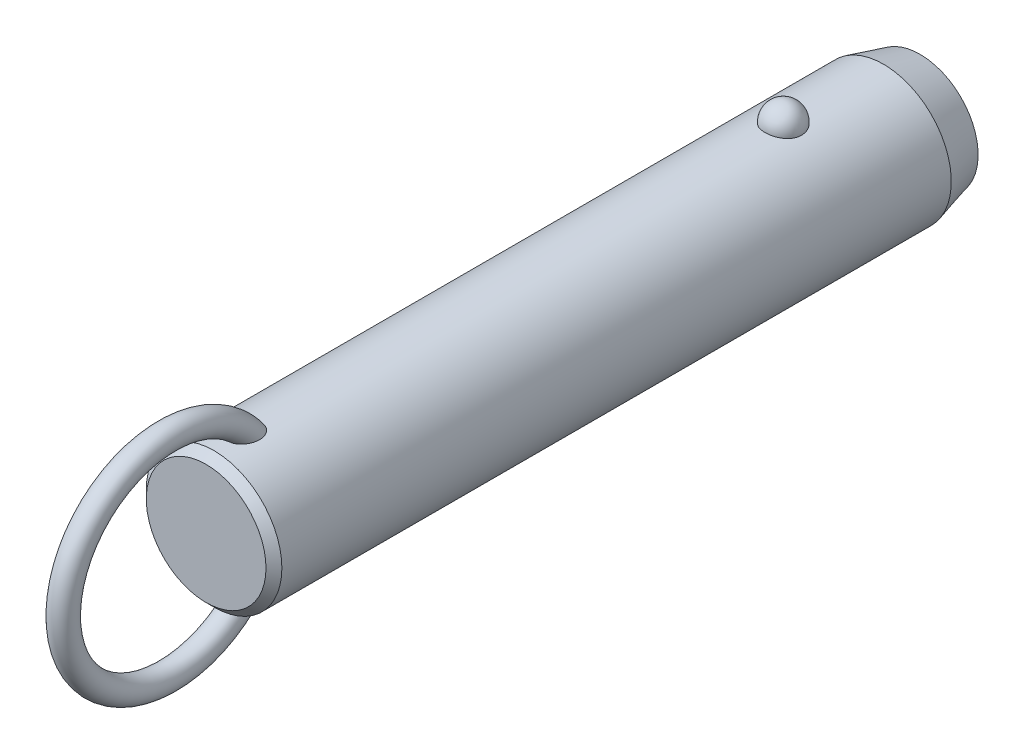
ISO-10303-21;
HEADER;
FILE_DESCRIPTION(('STEP AP214'),'2;1');
FILE_NAME('part.step','',(''),(''),'','','');
FILE_SCHEMA(('AUTOMOTIVE_DESIGN { 1 0 10303 214 1 1 1 1 }'));
ENDSEC;
DATA;
#1=APPLICATION_CONTEXT('core data for automotive mechanical design processes');
#2=APPLICATION_PROTOCOL_DEFINITION('international standard','automotive_design',2000,#1);
#3=PRODUCT_CONTEXT('',#1,'mechanical');
#4=PRODUCT('Part','Part','',(#3));
#5=PRODUCT_RELATED_PRODUCT_CATEGORY('part','',(#4));
#6=PRODUCT_DEFINITION_FORMATION('','',#4);
#7=PRODUCT_DEFINITION_CONTEXT('part definition',#1,'design');
#8=PRODUCT_DEFINITION('design','',#6,#7);
#9=PRODUCT_DEFINITION_SHAPE('','',#8);
#10=(LENGTH_UNIT() NAMED_UNIT(*) SI_UNIT(.MILLI.,.METRE.));
#11=(NAMED_UNIT(*) PLANE_ANGLE_UNIT() SI_UNIT($,.RADIAN.));
#12=(NAMED_UNIT(*) SI_UNIT($,.STERADIAN.) SOLID_ANGLE_UNIT());
#13=UNCERTAINTY_MEASURE_WITH_UNIT(LENGTH_MEASURE(1.E-05),#10,'distance_accuracy_value','');
#14=(GEOMETRIC_REPRESENTATION_CONTEXT(3) GLOBAL_UNCERTAINTY_ASSIGNED_CONTEXT((#13)) GLOBAL_UNIT_ASSIGNED_CONTEXT((#10,
#11,#12)) REPRESENTATION_CONTEXT('',''));
#15=CARTESIAN_POINT('',(0.,0.,0.));
#16=DIRECTION('',(0.,0.,1.));
#17=DIRECTION('',(1.,0.,0.));
#18=AXIS2_PLACEMENT_3D('',#15,#16,#17);
#19=CARTESIAN_POINT('',(0.,0.,78.8));
#20=DIRECTION('',(0.,0.,-1.));
#21=DIRECTION('',(-1.,0.,0.));
#22=AXIS2_PLACEMENT_3D('',#19,#20,#21);
#23=CYLINDRICAL_SURFACE('',#22,11.1);
#24=CARTESIAN_POINT('',(2.9724815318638,10.6945945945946,-3.));
#25=CARTESIAN_POINT('',(2.97247830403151,10.6945972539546,-2.83225059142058));
#26=CARTESIAN_POINT('',(2.95876598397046,10.6984356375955,-2.66445972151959));
#27=CARTESIAN_POINT('',(2.90424529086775,10.7133624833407,-2.33362381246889));
#28=CARTESIAN_POINT('',(2.8634252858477,10.7244540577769,-2.1705808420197));
#29=CARTESIAN_POINT('',(2.75573657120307,10.7526272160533,-1.85396767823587));
#30=CARTESIAN_POINT('',(2.68887937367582,10.7697061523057,-1.70039333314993));
#31=CARTESIAN_POINT('',(2.53079696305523,10.8079438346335,-1.40691598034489));
#32=CARTESIAN_POINT('',(2.43957264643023,10.8291024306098,-1.2670124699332));
#33=CARTESIAN_POINT('',(2.23458150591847,10.8732541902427,-1.00409565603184));
#34=CARTESIAN_POINT('',(2.12071295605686,10.8962553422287,-0.881162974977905));
#35=CARTESIAN_POINT('',(1.87365402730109,10.9414421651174,-0.656352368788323));
#36=CARTESIAN_POINT('',(1.74046358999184,10.9636278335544,-0.554474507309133));
#37=CARTESIAN_POINT('',(1.45872188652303,11.0046495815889,-0.374872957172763));
#38=CARTESIAN_POINT('',(1.31021276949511,11.0234944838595,-0.297085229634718));
#39=CARTESIAN_POINT('',(1.00170030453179,11.0557957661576,-0.167529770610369));
#40=CARTESIAN_POINT('',(0.841698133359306,11.0692526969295,-0.115759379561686));
#41=CARTESIAN_POINT('',(0.517607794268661,11.0890932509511,-0.0403925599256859));
#42=CARTESIAN_POINT('',(0.353633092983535,11.0955916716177,-0.0163383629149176));
#43=CARTESIAN_POINT('',(0.0238420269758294,11.1011989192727,0.0044517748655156));
#44=CARTESIAN_POINT('',(-0.141974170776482,11.1003084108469,0.00119017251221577));
#45=CARTESIAN_POINT('',(-0.468405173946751,11.0912990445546,-0.0323233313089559));
#46=CARTESIAN_POINT('',(-0.629059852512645,11.0832767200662,-0.0622147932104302));
#47=CARTESIAN_POINT('',(-0.942937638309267,11.0609962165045,-0.147645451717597));
#48=CARTESIAN_POINT('',(-1.09616062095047,11.0467379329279,-0.203185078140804));
#49=CARTESIAN_POINT('',(-1.39181061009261,11.0134071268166,-0.3387529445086));
#50=CARTESIAN_POINT('',(-1.53417383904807,10.9943086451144,-0.418913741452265));
#51=CARTESIAN_POINT('',(-1.80342160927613,10.9533667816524,-0.60144882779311));
#52=CARTESIAN_POINT('',(-1.9303046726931,10.9315231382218,-0.703825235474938));
#53=CARTESIAN_POINT('',(-2.16747598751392,10.887005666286,-0.930091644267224));
#54=CARTESIAN_POINT('',(-2.27742774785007,10.8643239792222,-1.05433291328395));
#55=CARTESIAN_POINT('',(-2.47517316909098,10.8209886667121,-1.31966633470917));
#56=CARTESIAN_POINT('',(-2.56296538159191,10.8003351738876,-1.46075958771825));
#57=CARTESIAN_POINT('',(-2.71500300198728,10.7631304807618,-1.75753646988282));
#58=CARTESIAN_POINT('',(-2.77898901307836,10.7466250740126,-1.91335887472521));
#59=CARTESIAN_POINT('',(-2.88046189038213,10.7198747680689,-2.2339152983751));
#60=CARTESIAN_POINT('',(-2.91794947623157,10.709629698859,-2.39864907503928));
#61=CARTESIAN_POINT('',(-2.96537819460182,10.6965949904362,-2.73165170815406));
#62=CARTESIAN_POINT('',(-2.97542891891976,10.693775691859,-2.89990378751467));
#63=CARTESIAN_POINT('',(-2.96804271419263,10.6958279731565,-3.235752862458));
#64=CARTESIAN_POINT('',(-2.95060646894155,10.7006993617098,-3.40334987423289));
#65=CARTESIAN_POINT('',(-2.88883358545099,10.71753912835,-3.73233906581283));
#66=CARTESIAN_POINT('',(-2.84462026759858,10.7294749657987,-3.89375610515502));
#67=CARTESIAN_POINT('',(-2.73050447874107,10.7590797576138,-4.20667949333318));
#68=CARTESIAN_POINT('',(-2.66060103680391,10.7767489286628,-4.35818546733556));
#69=CARTESIAN_POINT('',(-2.49642559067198,10.8159599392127,-4.6478542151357));
#70=CARTESIAN_POINT('',(-2.40203047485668,10.8375211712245,-4.78594458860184));
#71=CARTESIAN_POINT('',(-2.19143488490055,10.8820570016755,-5.0441038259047));
#72=CARTESIAN_POINT('',(-2.07523364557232,10.9050316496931,-5.16417205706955));
#73=CARTESIAN_POINT('',(-1.82361254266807,10.9499219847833,-5.38334833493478));
#74=CARTESIAN_POINT('',(-1.68812945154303,10.9718338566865,-5.48238464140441));
#75=CARTESIAN_POINT('',(-1.40191298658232,11.0120611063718,-5.65618873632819));
#76=CARTESIAN_POINT('',(-1.25118062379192,11.0303767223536,-5.73095813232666));
#77=CARTESIAN_POINT('',(-0.940570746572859,11.0611653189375,-5.85334725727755));
#78=CARTESIAN_POINT('',(-0.780821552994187,11.0737044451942,-5.90127578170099));
#79=CARTESIAN_POINT('',(-0.455204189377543,11.0918598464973,-5.96992976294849));
#80=CARTESIAN_POINT('',(-0.289336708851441,11.0974768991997,-5.99065827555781));
#81=CARTESIAN_POINT('',(0.0406846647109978,11.1011307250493,-6.00418773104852));
#82=CARTESIAN_POINT('',(0.204817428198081,11.099299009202,-5.99747318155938));
#83=CARTESIAN_POINT('',(0.5295530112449,11.088551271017,-5.9574031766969));
#84=CARTESIAN_POINT('',(0.69015594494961,11.0796354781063,-5.92404858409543));
#85=CARTESIAN_POINT('',(1.0027760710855,11.0557204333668,-5.83180084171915));
#86=CARTESIAN_POINT('',(1.15482001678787,11.0407414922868,-5.77299291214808));
#87=CARTESIAN_POINT('',(1.44678373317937,11.0062913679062,-5.63147366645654));
#88=CARTESIAN_POINT('',(1.58670279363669,10.9868199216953,-5.54876095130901));
#89=CARTESIAN_POINT('',(1.8527023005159,10.9451315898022,-5.36027644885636));
#90=CARTESIAN_POINT('',(1.97855158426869,10.9228788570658,-5.25418644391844));
#91=CARTESIAN_POINT('',(2.21080872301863,10.8782509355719,-5.02251354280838));
#92=CARTESIAN_POINT('',(2.31721312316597,10.8558757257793,-4.89692718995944));
#93=CARTESIAN_POINT('',(2.5094551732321,10.8130715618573,-4.62745408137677));
#94=CARTESIAN_POINT('',(2.59493284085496,10.7926798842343,-4.48330448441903));
#95=CARTESIAN_POINT('',(2.740862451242,10.7565495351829,-4.18236358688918));
#96=CARTESIAN_POINT('',(2.80132490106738,10.7408089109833,-4.02557762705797));
#97=CARTESIAN_POINT('',(2.88959070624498,10.7173718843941,-3.72475308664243));
#98=CARTESIAN_POINT('',(2.92062102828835,10.7088950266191,-3.58171216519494));
#99=CARTESIAN_POINT('',(2.96206765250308,10.6975052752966,-3.29245795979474));
#100=CARTESIAN_POINT('',(2.97248434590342,10.6945922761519,-3.14624473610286));
#101=CARTESIAN_POINT('',(2.9724815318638,10.6945945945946,-3.));
#102=B_SPLINE_CURVE_WITH_KNOTS('',3,(#24,#25,#26,#27,#28,#29,#30,#31,#32,#33,#34,#35,#36,#37,
#38,#39,#40,#41,#42,#43,#44,#45,#46,#47,#48,#49,#50,#51,#52,#53,#54,#55,#56,#57,#58,#59,#60,#61,
#62,#63,#64,#65,#66,#67,#68,#69,#70,#71,#72,#73,#74,#75,#76,#77,#78,#79,#80,#81,#82,#83,#84,#85,
#86,#87,#88,#89,#90,#91,#92,#93,#94,#95,#96,#97,#98,#99,#100,#101),.UNSPECIFIED.,.T.,.F.,(4,2,2,
2,2,2,2,2,2,2,2,2,2,2,2,2,2,2,2,2,2,2,2,2,2,2,2,2,2,2,2,2,2,2,2,2,2,2,4),(0.,0.502722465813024,
1.00566079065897,1.5083769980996,2.01107471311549,2.51608392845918,3.02109467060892,
3.52475118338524,4.02835620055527,4.523518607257,5.0186364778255,5.50715297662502,
5.9956776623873,6.48688002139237,6.97812923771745,7.47814366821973,7.9781907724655,
8.48353712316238,8.9888697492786,9.49218093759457,9.99547960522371,10.4964777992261,
10.997494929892,11.5010810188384,12.0046847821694,12.5099796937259,13.0152411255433,
13.5145635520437,14.0138298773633,14.5043200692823,14.9947943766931,15.4836390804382,
15.9725123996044,16.4685040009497,16.9645836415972,17.4686765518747,17.972557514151,
18.410841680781,18.849117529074),.UNSPECIFIED.);
#103=CARTESIAN_POINT('',(2.9724815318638,10.6945945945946,-3.));
#104=VERTEX_POINT('',#103);
#105=EDGE_CURVE('E41',#104,#104,#102,.T.);
#106=ORIENTED_EDGE('',*,*,#105,.T.);
#107=EDGE_LOOP('',(#106));
#108=FACE_BOUND('',#107,.T.);
#109=CARTESIAN_POINT('',(0.,0.,90.2));
#110=DIRECTION('',(0.,0.,1.));
#111=DIRECTION('',(1.,0.,0.));
#112=AXIS2_PLACEMENT_3D('',#109,#110,#111);
#113=CIRCLE('',#112,11.1);
#114=CARTESIAN_POINT('',(11.1,0.,90.2));
#115=VERTEX_POINT('',#114);
#116=EDGE_CURVE('E10',#115,#115,#113,.F.);
#117=ORIENTED_EDGE('',*,*,#116,.T.);
#118=EDGE_LOOP('',(#117));
#119=FACE_BOUND('',#118,.T.);
#120=CARTESIAN_POINT('',(-0.564520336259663,-11.0856356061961,82.4578154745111));
#121=CARTESIAN_POINT('',(-0.667202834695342,-11.0804062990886,82.4912839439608));
#122=CARTESIAN_POINT('',(-0.766875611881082,-11.0738877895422,82.5338357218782));
#123=CARTESIAN_POINT('',(-0.957284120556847,-11.0590576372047,82.6354190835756));
#124=CARTESIAN_POINT('',(-1.04801616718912,-11.0507452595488,82.6944574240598));
#125=CARTESIAN_POINT('',(-1.21800952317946,-11.0333016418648,82.8265293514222));
#126=CARTESIAN_POINT('',(-1.29730805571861,-11.0241732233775,82.8995156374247));
#127=CARTESIAN_POINT('',(-1.44337665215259,-11.0060026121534,83.0570374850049));
#128=CARTESIAN_POINT('',(-1.51014622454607,-10.9969604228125,83.1415734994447));
#129=CARTESIAN_POINT('',(-1.63454620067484,-10.9791841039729,83.3255213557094));
#130=CARTESIAN_POINT('',(-1.69127003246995,-10.9705107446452,83.4255493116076));
#131=CARTESIAN_POINT('',(-1.78980785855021,-10.9548648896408,83.6327902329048));
#132=CARTESIAN_POINT('',(-1.83161214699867,-10.9478935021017,83.7400078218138));
#133=CARTESIAN_POINT('',(-1.91557028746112,-10.9335803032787,84.0054080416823));
#134=CARTESIAN_POINT('',(-1.95040620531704,-10.9273269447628,84.1659806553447));
#135=CARTESIAN_POINT('',(-1.99388326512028,-10.9194709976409,84.4906977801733));
#136=CARTESIAN_POINT('',(-2.00248051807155,-10.9178762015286,84.6548478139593));
#137=CARTESIAN_POINT('',(-1.99551615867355,-10.9191578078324,85.0246504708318));
#138=CARTESIAN_POINT('',(-1.9732206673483,-10.9232807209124,85.2301911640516));
#139=CARTESIAN_POINT('',(-1.91529761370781,-10.9335244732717,85.5335954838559));
#140=CARTESIAN_POINT('',(-1.8918457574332,-10.9376266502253,85.6340883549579));
#141=CARTESIAN_POINT('',(-1.83700674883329,-10.9469720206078,85.832855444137));
#142=CARTESIAN_POINT('',(-1.80562070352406,-10.9522150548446,85.9311299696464));
#143=CARTESIAN_POINT('',(-1.73463055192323,-10.9636837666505,86.1259148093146));
#144=CARTESIAN_POINT('',(-1.69493416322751,-10.9699202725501,86.2223907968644));
#145=CARTESIAN_POINT('',(-1.6074514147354,-10.9830806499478,86.4116262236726));
#146=CARTESIAN_POINT('',(-1.55966150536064,-10.9900048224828,86.5043840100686));
#147=CARTESIAN_POINT('',(-1.45591812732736,-11.0042280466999,86.6846907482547));
#148=CARTESIAN_POINT('',(-1.40000013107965,-11.0115253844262,86.7722601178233));
#149=CARTESIAN_POINT('',(-1.27937470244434,-11.0261911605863,86.9410298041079));
#150=CARTESIAN_POINT('',(-1.21467835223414,-11.0335594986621,87.0222379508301));
#151=CARTESIAN_POINT('',(-1.08218150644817,-11.0473027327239,87.1690010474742));
#152=CARTESIAN_POINT('',(-1.01522633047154,-11.0537063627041,87.235309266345));
#153=CARTESIAN_POINT('',(-0.872952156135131,-11.065850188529,87.3583780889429));
#154=CARTESIAN_POINT('',(-0.797642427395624,-11.0715911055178,87.4151491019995));
#155=CARTESIAN_POINT('',(-0.651396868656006,-11.081071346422,87.5075155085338));
#156=CARTESIAN_POINT('',(-0.581712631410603,-11.0849841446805,87.5450491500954));
#157=CARTESIAN_POINT('',(-0.437066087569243,-11.0916271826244,87.6082594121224));
#158=CARTESIAN_POINT('',(-0.362109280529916,-11.0943586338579,87.6339481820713));
#159=CARTESIAN_POINT('',(-0.207828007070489,-11.0983242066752,87.671117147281));
#160=CARTESIAN_POINT('',(-0.128467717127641,-11.0995432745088,87.6824545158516));
#161=CARTESIAN_POINT('',(0.0309101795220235,-11.1002423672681,87.6889658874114));
#162=CARTESIAN_POINT('',(0.110927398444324,-11.0997233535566,87.6841488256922));
#163=CARTESIAN_POINT('',(0.256406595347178,-11.097240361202,87.6609599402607));
#164=CARTESIAN_POINT('',(0.32223577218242,-11.0955074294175,87.6447543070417));
#165=CARTESIAN_POINT('',(0.450635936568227,-11.0910350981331,87.6026008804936));
#166=CARTESIAN_POINT('',(0.513205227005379,-11.0882951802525,87.5766480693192));
#167=CARTESIAN_POINT('',(0.662626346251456,-11.0805620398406,87.5026073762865));
#168=CARTESIAN_POINT('',(0.747127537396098,-11.0751144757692,87.4498452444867));
#169=CARTESIAN_POINT('',(0.906756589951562,-11.0631932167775,87.3317206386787));
#170=CARTESIAN_POINT('',(0.981859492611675,-11.0567168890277,87.2663257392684));
#171=CARTESIAN_POINT('',(1.10712207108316,-11.0447856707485,87.1422633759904));
#172=CARTESIAN_POINT('',(1.15909566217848,-11.0394280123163,87.0853831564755));
#173=CARTESIAN_POINT('',(1.25791923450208,-11.0286040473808,86.9673271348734));
#174=CARTESIAN_POINT('',(1.30476642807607,-11.0231376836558,86.9061490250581));
#175=CARTESIAN_POINT('',(1.43818612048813,-11.0068027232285,86.717305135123));
#176=CARTESIAN_POINT('',(1.51751767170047,-10.9960104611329,86.5844531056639));
#177=CARTESIAN_POINT('',(1.63597546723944,-10.9788847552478,86.3531371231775));
#178=CARTESIAN_POINT('',(1.67988876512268,-10.9722190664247,86.2570530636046));
#179=CARTESIAN_POINT('',(1.75953241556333,-10.9597298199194,86.0614311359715));
#180=CARTESIAN_POINT('',(1.79525967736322,-10.9539065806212,85.9618919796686));
#181=CARTESIAN_POINT('',(1.85844731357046,-10.9433632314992,85.7602111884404));
#182=CARTESIAN_POINT('',(1.88591073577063,-10.9386427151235,85.6580705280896));
#183=CARTESIAN_POINT('',(1.93234324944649,-10.9305350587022,85.4518191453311));
#184=CARTESIAN_POINT('',(1.95131065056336,-10.9271481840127,85.3477080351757));
#185=CARTESIAN_POINT('',(1.99040203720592,-10.9201183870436,85.0654588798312));
#186=CARTESIAN_POINT('',(2.00221217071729,-10.9179256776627,84.8860370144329));
#187=CARTESIAN_POINT('',(1.99711676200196,-10.9188636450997,84.5277133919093));
#188=CARTESIAN_POINT('',(1.98026150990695,-10.9219849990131,84.348811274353));
#189=CARTESIAN_POINT('',(1.92151657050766,-10.9324473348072,84.0364514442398));
#190=CARTESIAN_POINT('',(1.88605081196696,-10.9386915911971,83.9017594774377));
#191=CARTESIAN_POINT('',(1.7939302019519,-10.9541780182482,83.6399669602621));
#192=CARTESIAN_POINT('',(1.73729868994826,-10.9634168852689,83.5128582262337));
#193=CARTESIAN_POINT('',(1.612370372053,-10.9824218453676,83.2894184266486));
#194=CARTESIAN_POINT('',(1.54715374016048,-10.9918945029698,83.1913455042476));
#195=CARTESIAN_POINT('',(1.40127026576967,-11.0114415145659,83.0074341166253));
#196=CARTESIAN_POINT('',(1.32060742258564,-11.0215157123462,82.9215924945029));
#197=CARTESIAN_POINT('',(1.14474787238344,-11.041168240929,82.7651630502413));
#198=CARTESIAN_POINT('',(1.04947805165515,-11.0507437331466,82.6946565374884));
#199=CARTESIAN_POINT('',(0.847278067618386,-11.0680789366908,82.572640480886));
#200=CARTESIAN_POINT('',(0.74035174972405,-11.0758392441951,82.5211246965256));
#201=CARTESIAN_POINT('',(0.52928931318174,-11.0878275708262,82.4434852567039));
#202=CARTESIAN_POINT('',(0.425895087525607,-11.0923259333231,82.415377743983));
#203=CARTESIAN_POINT('',(0.215723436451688,-11.0984001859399,82.3777038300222));
#204=CARTESIAN_POINT('',(0.108947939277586,-11.0999777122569,82.3681270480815));
#205=CARTESIAN_POINT('',(-0.0938962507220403,-11.1000196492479,82.3678773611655));
#206=CARTESIAN_POINT('',(-0.189967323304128,-11.0987797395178,82.3754089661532));
#207=CARTESIAN_POINT('',(-0.379657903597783,-11.0939111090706,82.4055079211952));
#208=CARTESIAN_POINT('',(-0.473277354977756,-11.0902823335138,82.4280756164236));
#209=CARTESIAN_POINT('',(-0.564520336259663,-11.0856356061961,82.4578154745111));
#210=B_SPLINE_CURVE_WITH_KNOTS('',3,(#120,#121,#122,#123,#124,#125,#126,#127,#128,#129,#130,
#131,#132,#133,#134,#135,#136,#137,#138,#139,#140,#141,#142,#143,#144,#145,#146,#147,#148,#149,
#150,#151,#152,#153,#154,#155,#156,#157,#158,#159,#160,#161,#162,#163,#164,#165,#166,#167,#168,
#169,#170,#171,#172,#173,#174,#175,#176,#177,#178,#179,#180,#181,#182,#183,#184,#185,#186,#187,
#188,#189,#190,#191,#192,#193,#194,#195,#196,#197,#198,#199,#200,#201,#202,#203,#204,#205,#206,
#207,#208,#209),.UNSPECIFIED.,.T.,.F.,(4,2,2,2,2,2,2,2,2,2,2,2,2,2,2,2,2,2,2,2,2,2,2,2,2,2,2,2,
2,2,2,2,2,2,2,2,2,2,2,2,2,2,2,2,4),(0.,0.323999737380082,0.648132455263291,0.971184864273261,
1.29424994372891,1.63886237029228,1.98369857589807,2.47426059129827,2.96564271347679,
3.58257396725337,3.89215258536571,4.20168803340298,4.51486273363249,4.82817514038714,
5.14015911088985,5.45175282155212,5.73442856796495,6.01679375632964,6.25364580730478,
6.49025437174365,6.7291996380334,6.96801276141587,7.17061258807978,7.37331685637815,
7.67094989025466,7.96935728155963,8.20075067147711,8.43226927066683,8.89581623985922,
9.2130653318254,9.53043400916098,9.84768549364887,10.1650000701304,10.70229304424,
11.2386443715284,11.6553390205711,12.0715755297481,12.4245637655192,12.7774607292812,
13.1321855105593,13.4867936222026,13.8068771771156,14.1267813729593,14.4146787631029,
14.7025827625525),.UNSPECIFIED.);
#211=CARTESIAN_POINT('',(-0.564520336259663,-11.0856356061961,82.4578154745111));
#212=VERTEX_POINT('',#211);
#213=EDGE_CURVE('E60',#212,#212,#210,.T.);
#214=ORIENTED_EDGE('',*,*,#213,.T.);
#215=EDGE_LOOP('',(#214));
#216=FACE_BOUND('',#215,.T.);
#217=CARTESIAN_POINT('',(-0.564520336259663,11.0856356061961,82.4578154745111));
#218=CARTESIAN_POINT('',(-0.468542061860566,11.0905203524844,82.4265456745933));
#219=CARTESIAN_POINT('',(-0.36979381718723,11.0942886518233,82.4031576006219));
#220=CARTESIAN_POINT('',(-0.169555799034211,11.0991586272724,82.3730858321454));
#221=CARTESIAN_POINT('',(-0.0680604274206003,11.1002543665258,82.3664393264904));
#222=CARTESIAN_POINT('',(0.134549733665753,11.099646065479,82.3701579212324));
#223=CARTESIAN_POINT('',(0.235664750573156,11.0979441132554,82.3805103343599));
#224=CARTESIAN_POINT('',(0.43463240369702,11.0919342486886,82.4178318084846));
#225=CARTESIAN_POINT('',(0.53248665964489,11.0876276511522,82.4447924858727));
#226=CARTESIAN_POINT('',(0.72244585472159,11.0768742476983,82.5144096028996));
#227=CARTESIAN_POINT('',(0.814543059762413,11.0704246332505,82.5570866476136));
#228=CARTESIAN_POINT('',(0.990565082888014,11.0560659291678,82.6566487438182));
#229=CARTESIAN_POINT('',(1.07448844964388,11.048156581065,82.7135363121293));
#230=CARTESIAN_POINT('',(1.23562672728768,11.0313221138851,82.8422106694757));
#231=CARTESIAN_POINT('',(1.31242684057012,11.0223686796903,82.9145117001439));
#232=CARTESIAN_POINT('',(1.45398030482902,11.0045918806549,83.0700425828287));
#233=CARTESIAN_POINT('',(1.51873073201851,10.9957685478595,83.1532750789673));
#234=CARTESIAN_POINT('',(1.64107232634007,10.9782087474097,83.3363842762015));
#235=CARTESIAN_POINT('',(1.69743176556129,10.9695572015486,83.4370893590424));
#236=CARTESIAN_POINT('',(1.79515063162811,10.9539887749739,83.6456264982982));
#237=CARTESIAN_POINT('',(1.83649966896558,10.9470730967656,83.7534634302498));
#238=CARTESIAN_POINT('',(1.91931148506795,10.9329211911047,84.0203995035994));
#239=CARTESIAN_POINT('',(1.9534010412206,10.9267904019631,84.1818612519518));
#240=CARTESIAN_POINT('',(1.99526195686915,10.9192174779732,84.5082163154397));
#241=CARTESIAN_POINT('',(2.00298989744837,10.9177830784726,84.6731148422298));
#242=CARTESIAN_POINT('',(1.99396251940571,10.9194420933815,85.0441006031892));
#243=CARTESIAN_POINT('',(1.97050829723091,10.923774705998,85.2500387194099));
#244=CARTESIAN_POINT('',(1.91079643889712,10.9343131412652,85.5539019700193));
#245=CARTESIAN_POINT('',(1.88673702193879,10.9385106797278,85.6545296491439));
#246=CARTESIAN_POINT('',(1.83065508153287,10.9480376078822,85.8535107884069));
#247=CARTESIAN_POINT('',(1.79863369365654,10.9533668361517,85.951864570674));
#248=CARTESIAN_POINT('',(1.72633365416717,10.9649954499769,86.146720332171));
#249=CARTESIAN_POINT('',(1.68596409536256,10.9713053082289,86.2431879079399));
#250=CARTESIAN_POINT('',(1.59707998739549,10.9845964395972,86.4323233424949));
#251=CARTESIAN_POINT('',(1.54856169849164,10.9915780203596,86.5249894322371));
#252=CARTESIAN_POINT('',(1.44330168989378,11.0058935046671,86.7049752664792));
#253=CARTESIAN_POINT('',(1.38659749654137,11.0132257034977,86.792316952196));
#254=CARTESIAN_POINT('',(1.26431158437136,11.0279330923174,86.9604563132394));
#255=CARTESIAN_POINT('',(1.19874160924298,11.0353082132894,87.0412624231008));
#256=CARTESIAN_POINT('',(1.06542088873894,11.0489310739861,87.1859856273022));
#257=CARTESIAN_POINT('',(0.998640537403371,11.0552153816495,87.250784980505));
#258=CARTESIAN_POINT('',(0.856896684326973,11.0671032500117,87.370846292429));
#259=CARTESIAN_POINT('',(0.781942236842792,11.0727075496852,87.4261186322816));
#260=CARTESIAN_POINT('',(0.636276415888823,11.081949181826,87.5159721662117));
#261=CARTESIAN_POINT('',(0.5667558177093,11.0857572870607,87.5524410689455));
#262=CARTESIAN_POINT('',(0.422602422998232,11.0921860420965,87.6135333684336));
#263=CARTESIAN_POINT('',(0.347974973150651,11.0948079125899,87.6381689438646));
#264=CARTESIAN_POINT('',(0.194593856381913,11.0985608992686,87.6733233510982));
#265=CARTESIAN_POINT('',(0.115807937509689,11.0996777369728,87.6837069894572));
#266=CARTESIAN_POINT('',(-0.0422499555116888,11.1002003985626,87.6885747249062));
#267=CARTESIAN_POINT('',(-0.121521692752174,11.09960699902,87.683066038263));
#268=CARTESIAN_POINT('',(-0.266046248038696,11.0970123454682,87.6588271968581));
#269=CARTESIAN_POINT('',(-0.331661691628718,11.0952283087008,87.6421356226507));
#270=CARTESIAN_POINT('',(-0.459588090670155,11.0906663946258,87.5991117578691));
#271=CARTESIAN_POINT('',(-0.521897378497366,11.0878880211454,87.572774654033));
#272=CARTESIAN_POINT('',(-0.671446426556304,11.0800342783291,87.4975130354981));
#273=CARTESIAN_POINT('',(-0.756250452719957,11.0744969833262,87.4438182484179));
#274=CARTESIAN_POINT('',(-0.916349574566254,11.0624045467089,87.3238029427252));
#275=CARTESIAN_POINT('',(-0.991618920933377,11.0558467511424,87.2574493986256));
#276=CARTESIAN_POINT('',(-1.11713140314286,11.0437783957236,87.1316335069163));
#277=CARTESIAN_POINT('',(-1.16920539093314,11.0383619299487,87.0739524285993));
#278=CARTESIAN_POINT('',(-1.26817476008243,11.02743010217,86.9542809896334));
#279=CARTESIAN_POINT('',(-1.31506731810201,11.0219146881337,86.8922883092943));
#280=CARTESIAN_POINT('',(-1.40399813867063,11.0109399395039,86.7647843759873));
#281=CARTESIAN_POINT('',(-1.4460286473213,11.0054807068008,86.6992677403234));
#282=CARTESIAN_POINT('',(-1.52538779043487,10.9947621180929,86.5654223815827));
#283=CARTESIAN_POINT('',(-1.56271516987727,10.9895028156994,86.4970929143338));
#284=CARTESIAN_POINT('',(-1.64537943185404,10.9774790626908,86.3332101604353));
#285=CARTESIAN_POINT('',(-1.68879497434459,10.9708503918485,86.2366735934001));
#286=CARTESIAN_POINT('',(-1.76740738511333,10.9584602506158,86.0402369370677));
#287=CARTESIAN_POINT('',(-1.80260120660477,10.95269910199,85.9403356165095));
#288=CARTESIAN_POINT('',(-1.86468657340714,10.9423003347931,85.7379663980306));
#289=CARTESIAN_POINT('',(-1.8915816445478,10.9376622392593,85.6354996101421));
#290=CARTESIAN_POINT('',(-1.93682458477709,10.9297405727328,85.4286429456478));
#291=CARTESIAN_POINT('',(-1.9551708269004,10.9264572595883,85.3242527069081));
#292=CARTESIAN_POINT('',(-1.99232562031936,10.9197647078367,85.0426287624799));
#293=CARTESIAN_POINT('',(-2.00294603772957,10.9177914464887,84.8641857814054));
#294=CARTESIAN_POINT('',(-1.99566675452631,10.9191290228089,84.5079962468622));
#295=CARTESIAN_POINT('',(-1.97781651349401,10.9224306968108,84.3302490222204));
#296=CARTESIAN_POINT('',(-1.91747214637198,10.9331592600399,84.0197921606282));
#297=CARTESIAN_POINT('',(-1.88131022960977,10.9395108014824,83.885825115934));
#298=CARTESIAN_POINT('',(-1.78790380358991,10.9551659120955,83.6255975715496));
#299=CARTESIAN_POINT('',(-1.7306830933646,10.9644661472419,83.4993285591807));
#300=CARTESIAN_POINT('',(-1.60475573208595,10.9835398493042,83.2774156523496));
#301=CARTESIAN_POINT('',(-1.53908879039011,10.9930297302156,83.1800265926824));
#302=CARTESIAN_POINT('',(-1.39238608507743,11.0125708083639,82.9975250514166));
#303=CARTESIAN_POINT('',(-1.31135150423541,11.0226219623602,82.9124116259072));
#304=CARTESIAN_POINT('',(-1.14382035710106,11.0411991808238,82.7652994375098));
#305=CARTESIAN_POINT('',(-1.05858500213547,11.0497792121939,82.7018693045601));
#306=CARTESIAN_POINT('',(-0.878723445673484,11.0655285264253,82.5902505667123));
#307=CARTESIAN_POINT('',(-0.784123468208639,11.0727015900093,82.5420208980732));
#308=CARTESIAN_POINT('',(-0.646163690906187,11.0812501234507,82.486023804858));
#309=CARTESIAN_POINT('',(-0.605595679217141,11.0835451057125,82.4711978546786));
#310=CARTESIAN_POINT('',(-0.564520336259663,11.0856356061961,82.4578154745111));
#311=B_SPLINE_CURVE_WITH_KNOTS('',3,(#217,#218,#219,#220,#221,#222,#223,#224,#225,#226,#227,
#228,#229,#230,#231,#232,#233,#234,#235,#236,#237,#238,#239,#240,#241,#242,#243,#244,#245,#246,
#247,#248,#249,#250,#251,#252,#253,#254,#255,#256,#257,#258,#259,#260,#261,#262,#263,#264,#265,
#266,#267,#268,#269,#270,#271,#272,#273,#274,#275,#276,#277,#278,#279,#280,#281,#282,#283,#284,
#285,#286,#287,#288,#289,#290,#291,#292,#293,#294,#295,#296,#297,#298,#299,#300,#301,#302,#303,
#304,#305,#306,#307,#308,#309,#310),.UNSPECIFIED.,.T.,.F.,(4,2,2,2,2,2,2,2,2,2,2,2,2,2,2,2,2,2,
2,2,2,2,2,2,2,2,2,2,2,2,2,2,2,2,2,2,2,2,2,2,2,2,2,2,2,2,4),(0.,0.303061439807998,
0.606795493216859,0.910302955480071,1.21365733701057,1.51741085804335,1.82121821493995,
2.1374520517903,2.45376252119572,2.79958678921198,3.14564996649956,3.63832391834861,
4.13180893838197,4.75031912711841,5.06071926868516,5.37107516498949,5.68500772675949,
5.99908475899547,6.31176519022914,6.62403542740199,6.90315673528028,7.1819719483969,
7.41687778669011,7.65154134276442,7.88841587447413,8.12518286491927,8.3275284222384,
8.52997509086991,8.82986421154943,9.13054668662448,9.36393502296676,9.59744991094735,
9.83133221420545,10.0652767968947,10.383032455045,10.7009056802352,11.0186436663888,
11.3364420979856,11.8705925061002,12.4038159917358,12.8189662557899,13.2336487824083,
13.5857049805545,13.9377340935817,14.2561354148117,14.5736690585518,14.7033687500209),.UNSPECIFIED.);
#312=CARTESIAN_POINT('',(-0.564520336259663,11.0856356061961,82.4578154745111));
#313=VERTEX_POINT('',#312);
#314=EDGE_CURVE('E67',#313,#313,#311,.T.);
#315=ORIENTED_EDGE('',*,*,#314,.T.);
#316=EDGE_LOOP('',(#315));
#317=FACE_BOUND('',#316,.T.);
#318=CARTESIAN_POINT('',(0.,0.,-19.3999999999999));
#319=DIRECTION('',(0.,0.,-1.));
#320=DIRECTION('',(-1.,0.,0.));
#321=AXIS2_PLACEMENT_3D('',#318,#319,#320);
#322=CIRCLE('',#321,11.1);
#323=CARTESIAN_POINT('',(-11.1,0.,-19.3999999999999));
#324=VERTEX_POINT('',#323);
#325=EDGE_CURVE('E57',#324,#324,#322,.F.);
#326=ORIENTED_EDGE('',*,*,#325,.T.);
#327=EDGE_LOOP('',(#326));
#328=FACE_BOUND('',#327,.T.);
#329=ADVANCED_FACE('F37',(#108,#119,#216,#317,#328),#23,.T.);
#330=CARTESIAN_POINT('',(0.,0.,-25.4));
#331=DIRECTION('',(0.,0.,-1.));
#332=DIRECTION('',(-1.,0.,0.));
#333=AXIS2_PLACEMENT_3D('',#330,#331,#332);
#334=PLANE('',#333);
#335=CARTESIAN_POINT('',(0.,0.,-25.4));
#336=DIRECTION('',(0.,0.,-1.));
#337=DIRECTION('',(-1.,0.,0.));
#338=AXIS2_PLACEMENT_3D('',#335,#336,#337);
#339=CIRCLE('',#338,9.49230484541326);
#340=CARTESIAN_POINT('',(-9.49230484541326,0.,-25.4));
#341=VERTEX_POINT('',#340);
#342=EDGE_CURVE('E66',#341,#341,#339,.T.);
#343=ORIENTED_EDGE('',*,*,#342,.T.);
#344=EDGE_LOOP('',(#343));
#345=FACE_BOUND('',#344,.T.);
#346=ADVANCED_FACE('F85',(#345),#334,.T.);
#347=CARTESIAN_POINT('',(0.,0.,-25.4));
#348=DIRECTION('',(0.,0.,1.));
#349=DIRECTION('',(1.,0.,0.));
#350=AXIS2_PLACEMENT_3D('',#347,#348,#349);
#351=CONICAL_SURFACE('',#350,9.49230484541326,0.261799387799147);
#352=ORIENTED_EDGE('',*,*,#325,.F.);
#353=EDGE_LOOP('',(#352));
#354=FACE_BOUND('',#353,.T.);
#355=ORIENTED_EDGE('',*,*,#342,.F.);
#356=EDGE_LOOP('',(#355));
#357=FACE_BOUND('',#356,.T.);
#358=ADVANCED_FACE('F83',(#354,#357),#351,.T.);
#359=CARTESIAN_POINT('',(0.,0.,91.5));
#360=DIRECTION('',(0.,0.,1.));
#361=DIRECTION('',(1.,0.,0.));
#362=AXIS2_PLACEMENT_3D('',#359,#360,#361);
#363=PLANE('',#362);
#364=CARTESIAN_POINT('',(0.,0.,91.5));
#365=DIRECTION('',(0.,0.,1.));
#366=DIRECTION('',(1.,0.,0.));
#367=AXIS2_PLACEMENT_3D('',#364,#365,#366);
#368=CIRCLE('',#367,9.8);
#369=CARTESIAN_POINT('',(9.8,0.,91.5));
#370=VERTEX_POINT('',#369);
#371=EDGE_CURVE('E50',#370,#370,#368,.T.);
#372=ORIENTED_EDGE('',*,*,#371,.T.);
#373=EDGE_LOOP('',(#372));
#374=FACE_BOUND('',#373,.T.);
#375=ADVANCED_FACE('F77',(#374),#363,.T.);
#376=CARTESIAN_POINT('',(0.,0.,97.85));
#377=DIRECTION('',(1.,0.,0.));
#378=DIRECTION('',(0.,0.,-1.));
#379=AXIS2_PLACEMENT_3D('',#376,#377,#378);
#380=TOROIDAL_SURFACE('',#379,17.05,2.);
#381=ORIENTED_EDGE('',*,*,#314,.F.);
#382=EDGE_LOOP('',(#381));
#383=FACE_BOUND('',#382,.T.);
#384=ORIENTED_EDGE('',*,*,#213,.F.);
#385=EDGE_LOOP('',(#384));
#386=FACE_BOUND('',#385,.T.);
#387=ADVANCED_FACE('F73',(#383,#386),#380,.T.);
#388=CARTESIAN_POINT('',(0.,0.,91.5));
#389=DIRECTION('',(0.,0.,-1.));
#390=DIRECTION('',(-1.,0.,0.));
#391=AXIS2_PLACEMENT_3D('',#388,#389,#390);
#392=CONICAL_SURFACE('',#391,9.8,0.785398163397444);
#393=ORIENTED_EDGE('',*,*,#116,.F.);
#394=EDGE_LOOP('',(#393));
#395=FACE_BOUND('',#394,.T.);
#396=ORIENTED_EDGE('',*,*,#371,.F.);
#397=EDGE_LOOP('',(#396));
#398=FACE_BOUND('',#397,.T.);
#399=ADVANCED_FACE('F39',(#395,#398),#392,.T.);
#400=CARTESIAN_POINT('',(0.,11.1,-3.));
#401=DIRECTION('',(0.,1.,0.));
#402=DIRECTION('',(0.,0.,-1.));
#403=AXIS2_PLACEMENT_3D('',#400,#401,#402);
#404=SPHERICAL_SURFACE('',#403,3.);
#405=ORIENTED_EDGE('',*,*,#105,.F.);
#406=EDGE_LOOP('',(#405));
#407=FACE_BOUND('',#406,.T.);
#408=ADVANCED_FACE('F79',(#407),#404,.T.);
#409=CLOSED_SHELL('',(#329,#346,#358,#375,#387,#399,#408));
#410=MANIFOLD_SOLID_BREP('B2',#409);
#411=ADVANCED_BREP_SHAPE_REPRESENTATION('',(#18,#410),#14);
#412=SHAPE_DEFINITION_REPRESENTATION(#9,#411);
ENDSEC;
END-ISO-10303-21;
